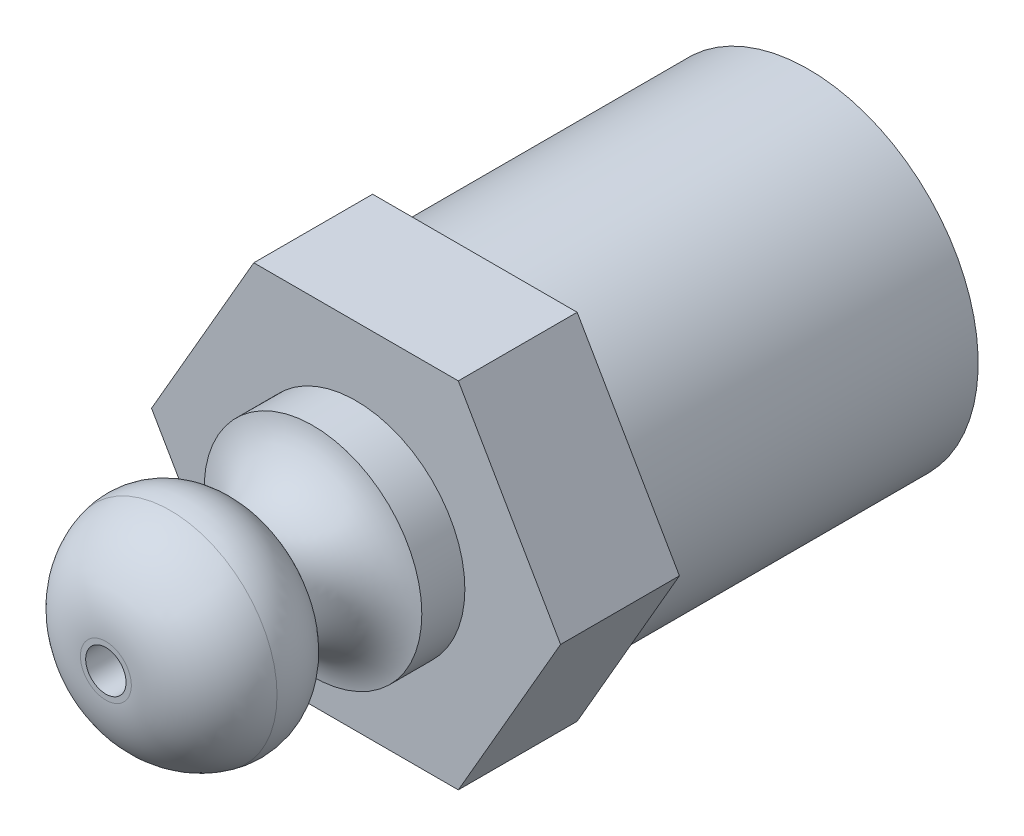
ISO-10303-21;
HEADER;
FILE_DESCRIPTION(('STEP AP214'),'2;1');
FILE_NAME('part.step','',(''),(''),'','','');
FILE_SCHEMA(('AUTOMOTIVE_DESIGN { 1 0 10303 214 1 1 1 1 }'));
ENDSEC;
DATA;
#1=APPLICATION_CONTEXT('core data for automotive mechanical design processes');
#2=APPLICATION_PROTOCOL_DEFINITION('international standard','automotive_design',2000,#1);
#3=PRODUCT_CONTEXT('',#1,'mechanical');
#4=PRODUCT('Part','Part','',(#3));
#5=PRODUCT_RELATED_PRODUCT_CATEGORY('part','',(#4));
#6=PRODUCT_DEFINITION_FORMATION('','',#4);
#7=PRODUCT_DEFINITION_CONTEXT('part definition',#1,'design');
#8=PRODUCT_DEFINITION('design','',#6,#7);
#9=PRODUCT_DEFINITION_SHAPE('','',#8);
#10=(LENGTH_UNIT() NAMED_UNIT(*) SI_UNIT(.MILLI.,.METRE.));
#11=(NAMED_UNIT(*) PLANE_ANGLE_UNIT() SI_UNIT($,.RADIAN.));
#12=(NAMED_UNIT(*) SI_UNIT($,.STERADIAN.) SOLID_ANGLE_UNIT());
#13=UNCERTAINTY_MEASURE_WITH_UNIT(LENGTH_MEASURE(1.E-05),#10,'distance_accuracy_value','');
#14=(GEOMETRIC_REPRESENTATION_CONTEXT(3) GLOBAL_UNCERTAINTY_ASSIGNED_CONTEXT((#13)) GLOBAL_UNIT_ASSIGNED_CONTEXT((#10,
#11,#12)) REPRESENTATION_CONTEXT('',''));
#15=CARTESIAN_POINT('',(0.,0.,0.));
#16=DIRECTION('',(0.,0.,1.));
#17=DIRECTION('',(1.,0.,0.));
#18=AXIS2_PLACEMENT_3D('',#15,#16,#17);
#19=CARTESIAN_POINT('',(0.,0.,-21.3995));
#20=DIRECTION('',(0.,0.,1.));
#21=DIRECTION('',(1.,0.,0.));
#22=AXIS2_PLACEMENT_3D('',#19,#20,#21);
#23=CYLINDRICAL_SURFACE('',#22,0.615298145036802);
#24=CARTESIAN_POINT('',(0.,0.,0.));
#25=DIRECTION('',(0.,0.,1.));
#26=DIRECTION('',(1.,0.,0.));
#27=AXIS2_PLACEMENT_3D('',#24,#25,#26);
#28=CIRCLE('',#27,0.615298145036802);
#29=CARTESIAN_POINT('',(0.615298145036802,0.,0.));
#30=VERTEX_POINT('',#29);
#31=EDGE_CURVE('E110',#30,#30,#28,.T.);
#32=ORIENTED_EDGE('',*,*,#31,.T.);
#33=EDGE_LOOP('',(#32));
#34=FACE_BOUND('',#33,.T.);
#35=CARTESIAN_POINT('',(0.,0.,-13.7795));
#36=DIRECTION('',(0.,0.,-1.));
#37=DIRECTION('',(-1.,0.,0.));
#38=AXIS2_PLACEMENT_3D('',#35,#36,#37);
#39=CIRCLE('',#38,0.615298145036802);
#40=CARTESIAN_POINT('',(-0.615298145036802,0.,-13.7795));
#41=VERTEX_POINT('',#40);
#42=EDGE_CURVE('E108',#41,#41,#39,.F.);
#43=ORIENTED_EDGE('',*,*,#42,.F.);
#44=EDGE_LOOP('',(#43));
#45=FACE_BOUND('',#44,.T.);
#46=ADVANCED_FACE('F16',(#34,#45),#23,.F.);
#47=CARTESIAN_POINT('',(-6.22935008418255,0.,-21.3995));
#48=DIRECTION('',(0.866025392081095,-0.500000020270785,0.));
#49=DIRECTION('',(0.500000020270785,0.866025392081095,0.));
#50=AXIS2_PLACEMENT_3D('',#47,#48,#49);
#51=PLANE('',#50);
#52=DIRECTION('',(-0.500000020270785,-0.866025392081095,0.));
#53=VECTOR('',#52,1.);
#54=CARTESIAN_POINT('',(-6.22935008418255,0.,-7.62));
#55=LINE('',#54,#53);
#56=CARTESIAN_POINT('',(-3.11467495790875,5.39477527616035,-7.62));
#57=VERTEX_POINT('',#56);
#58=CARTESIAN_POINT('',(-6.22935008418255,0.,-7.62));
#59=VERTEX_POINT('',#58);
#60=EDGE_CURVE('E31',#57,#59,#55,.T.);
#61=ORIENTED_EDGE('',*,*,#60,.F.);
#62=DIRECTION('',(0.,0.,1.));
#63=VECTOR('',#62,1.);
#64=CARTESIAN_POINT('',(-3.11467495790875,5.39477527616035,-21.3995));
#65=LINE('',#64,#63);
#66=CARTESIAN_POINT('',(-3.11467495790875,5.39477527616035,-11.2395));
#67=VERTEX_POINT('',#66);
#68=EDGE_CURVE('E102',#67,#57,#65,.T.);
#69=ORIENTED_EDGE('',*,*,#68,.F.);
#70=DIRECTION('',(0.500000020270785,0.866025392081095,0.));
#71=VECTOR('',#70,1.);
#72=CARTESIAN_POINT('',(-6.22935008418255,0.,-11.2395));
#73=LINE('',#72,#71);
#74=CARTESIAN_POINT('',(-6.22935008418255,0.,-11.2395));
#75=VERTEX_POINT('',#74);
#76=EDGE_CURVE('E93',#75,#67,#73,.T.);
#77=ORIENTED_EDGE('',*,*,#76,.F.);
#78=DIRECTION('',(0.,0.,1.));
#79=VECTOR('',#78,1.);
#80=CARTESIAN_POINT('',(-6.22935008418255,0.,-21.3995));
#81=LINE('',#80,#79);
#82=EDGE_CURVE('E89',#75,#59,#81,.T.);
#83=ORIENTED_EDGE('',*,*,#82,.T.);
#84=EDGE_LOOP('',(#61,#69,#77,#83));
#85=FACE_BOUND('',#84,.T.);
#86=ADVANCED_FACE('F18',(#85),#51,.F.);
#87=CARTESIAN_POINT('',(-3.11467495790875,5.39477527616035,-21.3995));
#88=DIRECTION('',(0.,-1.,0.));
#89=DIRECTION('',(1.,0.,0.));
#90=AXIS2_PLACEMENT_3D('',#87,#88,#89);
#91=PLANE('',#90);
#92=DIRECTION('',(-1.,0.,0.));
#93=VECTOR('',#92,1.);
#94=CARTESIAN_POINT('',(-3.11467495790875,5.39477527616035,-7.62));
#95=LINE('',#94,#93);
#96=CARTESIAN_POINT('',(3.11467495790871,5.39477527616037,-7.62));
#97=VERTEX_POINT('',#96);
#98=EDGE_CURVE('E193',#97,#57,#95,.T.);
#99=ORIENTED_EDGE('',*,*,#98,.F.);
#100=DIRECTION('',(0.,0.,1.));
#101=VECTOR('',#100,1.);
#102=CARTESIAN_POINT('',(3.11467495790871,5.39477527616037,-21.3995));
#103=LINE('',#102,#101);
#104=CARTESIAN_POINT('',(3.11467495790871,5.39477527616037,-11.2395));
#105=VERTEX_POINT('',#104);
#106=EDGE_CURVE('E99',#105,#97,#103,.T.);
#107=ORIENTED_EDGE('',*,*,#106,.F.);
#108=DIRECTION('',(1.,0.,0.));
#109=VECTOR('',#108,1.);
#110=CARTESIAN_POINT('',(-3.11467495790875,5.39477527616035,-11.2395));
#111=LINE('',#110,#109);
#112=EDGE_CURVE('E203',#67,#105,#111,.T.);
#113=ORIENTED_EDGE('',*,*,#112,.F.);
#114=ORIENTED_EDGE('',*,*,#68,.T.);
#115=EDGE_LOOP('',(#99,#107,#113,#114));
#116=FACE_BOUND('',#115,.T.);
#117=ADVANCED_FACE('F142',(#116),#91,.F.);
#118=CARTESIAN_POINT('',(3.11467495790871,5.39477527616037,-21.3995));
#119=DIRECTION('',(-0.866025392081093,-0.500000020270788,0.));
#120=DIRECTION('',(0.500000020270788,-0.866025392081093,0.));
#121=AXIS2_PLACEMENT_3D('',#118,#119,#120);
#122=PLANE('',#121);
#123=DIRECTION('',(-0.500000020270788,0.866025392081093,0.));
#124=VECTOR('',#123,1.);
#125=CARTESIAN_POINT('',(3.11467495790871,5.39477527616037,-7.62));
#126=LINE('',#125,#124);
#127=CARTESIAN_POINT('',(6.22935008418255,0.,-7.62));
#128=VERTEX_POINT('',#127);
#129=EDGE_CURVE('E196',#128,#97,#126,.T.);
#130=ORIENTED_EDGE('',*,*,#129,.F.);
#131=DIRECTION('',(0.,0.,1.));
#132=VECTOR('',#131,1.);
#133=CARTESIAN_POINT('',(6.22935008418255,0.,-21.3995));
#134=LINE('',#133,#132);
#135=CARTESIAN_POINT('',(6.22935008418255,0.,-11.2395));
#136=VERTEX_POINT('',#135);
#137=EDGE_CURVE('E91',#136,#128,#134,.T.);
#138=ORIENTED_EDGE('',*,*,#137,.F.);
#139=DIRECTION('',(0.500000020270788,-0.866025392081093,0.));
#140=VECTOR('',#139,1.);
#141=CARTESIAN_POINT('',(3.11467495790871,5.39477527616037,-11.2395));
#142=LINE('',#141,#140);
#143=EDGE_CURVE('E201',#105,#136,#142,.T.);
#144=ORIENTED_EDGE('',*,*,#143,.F.);
#145=ORIENTED_EDGE('',*,*,#106,.T.);
#146=EDGE_LOOP('',(#130,#138,#144,#145));
#147=FACE_BOUND('',#146,.T.);
#148=ADVANCED_FACE('F181',(#147),#122,.F.);
#149=CARTESIAN_POINT('',(6.22935008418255,0.,-21.3995));
#150=DIRECTION('',(-0.866025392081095,0.500000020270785,0.));
#151=DIRECTION('',(-0.500000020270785,-0.866025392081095,0.));
#152=AXIS2_PLACEMENT_3D('',#149,#150,#151);
#153=PLANE('',#152);
#154=DIRECTION('',(0.500000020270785,0.866025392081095,0.));
#155=VECTOR('',#154,1.);
#156=CARTESIAN_POINT('',(6.22935008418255,0.,-7.62));
#157=LINE('',#156,#155);
#158=CARTESIAN_POINT('',(3.11467495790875,-5.39477527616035,-7.62));
#159=VERTEX_POINT('',#158);
#160=EDGE_CURVE('E85',#159,#128,#157,.T.);
#161=ORIENTED_EDGE('',*,*,#160,.F.);
#162=DIRECTION('',(0.,0.,1.));
#163=VECTOR('',#162,1.);
#164=CARTESIAN_POINT('',(3.11467495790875,-5.39477527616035,-21.3995));
#165=LINE('',#164,#163);
#166=CARTESIAN_POINT('',(3.11467495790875,-5.39477527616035,-11.2395));
#167=VERTEX_POINT('',#166);
#168=EDGE_CURVE('E84',#167,#159,#165,.T.);
#169=ORIENTED_EDGE('',*,*,#168,.F.);
#170=DIRECTION('',(-0.500000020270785,-0.866025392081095,0.));
#171=VECTOR('',#170,1.);
#172=CARTESIAN_POINT('',(6.22935008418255,0.,-11.2395));
#173=LINE('',#172,#171);
#174=EDGE_CURVE('E204',#136,#167,#173,.T.);
#175=ORIENTED_EDGE('',*,*,#174,.F.);
#176=ORIENTED_EDGE('',*,*,#137,.T.);
#177=EDGE_LOOP('',(#161,#169,#175,#176));
#178=FACE_BOUND('',#177,.T.);
#179=ADVANCED_FACE('F178',(#178),#153,.F.);
#180=CARTESIAN_POINT('',(3.11467495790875,-5.39477527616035,-21.3995));
#181=DIRECTION('',(0.,1.,0.));
#182=DIRECTION('',(-1.,0.,0.));
#183=AXIS2_PLACEMENT_3D('',#180,#181,#182);
#184=PLANE('',#183);
#185=DIRECTION('',(1.,0.,0.));
#186=VECTOR('',#185,1.);
#187=CARTESIAN_POINT('',(3.11467495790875,-5.39477527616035,-7.62));
#188=LINE('',#187,#186);
#189=CARTESIAN_POINT('',(-3.11467495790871,-5.39477527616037,-7.62));
#190=VERTEX_POINT('',#189);
#191=EDGE_CURVE('E69',#190,#159,#188,.T.);
#192=ORIENTED_EDGE('',*,*,#191,.F.);
#193=DIRECTION('',(0.,0.,1.));
#194=VECTOR('',#193,1.);
#195=CARTESIAN_POINT('',(-3.11467495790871,-5.39477527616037,-21.3995));
#196=LINE('',#195,#194);
#197=CARTESIAN_POINT('',(-3.11467495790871,-5.39477527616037,-11.2395));
#198=VERTEX_POINT('',#197);
#199=EDGE_CURVE('E82',#198,#190,#196,.T.);
#200=ORIENTED_EDGE('',*,*,#199,.F.);
#201=DIRECTION('',(-1.,0.,0.));
#202=VECTOR('',#201,1.);
#203=CARTESIAN_POINT('',(3.11467495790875,-5.39477527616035,-11.2395));
#204=LINE('',#203,#202);
#205=EDGE_CURVE('E39',#167,#198,#204,.T.);
#206=ORIENTED_EDGE('',*,*,#205,.F.);
#207=ORIENTED_EDGE('',*,*,#168,.T.);
#208=EDGE_LOOP('',(#192,#200,#206,#207));
#209=FACE_BOUND('',#208,.T.);
#210=ADVANCED_FACE('F81',(#209),#184,.F.);
#211=CARTESIAN_POINT('',(-3.11467495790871,-5.39477527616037,-21.3995));
#212=DIRECTION('',(0.866025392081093,0.500000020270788,0.));
#213=DIRECTION('',(-0.500000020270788,0.866025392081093,0.));
#214=AXIS2_PLACEMENT_3D('',#211,#212,#213);
#215=PLANE('',#214);
#216=DIRECTION('',(0.500000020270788,-0.866025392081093,0.));
#217=VECTOR('',#216,1.);
#218=CARTESIAN_POINT('',(-3.11467495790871,-5.39477527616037,-7.62));
#219=LINE('',#218,#217);
#220=EDGE_CURVE('E66',#59,#190,#219,.T.);
#221=ORIENTED_EDGE('',*,*,#220,.F.);
#222=ORIENTED_EDGE('',*,*,#82,.F.);
#223=DIRECTION('',(-0.500000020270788,0.866025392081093,0.));
#224=VECTOR('',#223,1.);
#225=CARTESIAN_POINT('',(-3.11467495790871,-5.39477527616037,-11.2395));
#226=LINE('',#225,#224);
#227=EDGE_CURVE('E76',#198,#75,#226,.T.);
#228=ORIENTED_EDGE('',*,*,#227,.F.);
#229=ORIENTED_EDGE('',*,*,#199,.T.);
#230=EDGE_LOOP('',(#221,#222,#228,#229));
#231=FACE_BOUND('',#230,.T.);
#232=ADVANCED_FACE('F88',(#231),#215,.F.);
#233=CARTESIAN_POINT('',(0.,0.,-11.2395));
#234=DIRECTION('',(0.,0.,-1.));
#235=DIRECTION('',(-1.,0.,0.));
#236=AXIS2_PLACEMENT_3D('',#233,#234,#235);
#237=PLANE('',#236);
#238=CARTESIAN_POINT('',(0.,0.,-11.2395));
#239=DIRECTION('',(0.,0.,-1.));
#240=DIRECTION('',(-1.,0.,0.));
#241=AXIS2_PLACEMENT_3D('',#238,#239,#240);
#242=CIRCLE('',#241,5.1689);
#243=CARTESIAN_POINT('',(-5.1689,0.,-11.2395));
#244=VERTEX_POINT('',#243);
#245=EDGE_CURVE('E213',#244,#244,#242,.T.);
#246=ORIENTED_EDGE('',*,*,#245,.F.);
#247=EDGE_LOOP('',(#246));
#248=FACE_BOUND('',#247,.T.);
#249=ORIENTED_EDGE('',*,*,#76,.T.);
#250=ORIENTED_EDGE('',*,*,#112,.T.);
#251=ORIENTED_EDGE('',*,*,#143,.T.);
#252=ORIENTED_EDGE('',*,*,#174,.T.);
#253=ORIENTED_EDGE('',*,*,#205,.T.);
#254=ORIENTED_EDGE('',*,*,#227,.T.);
#255=EDGE_LOOP('',(#249,#250,#251,#252,#253,#254));
#256=FACE_BOUND('',#255,.T.);
#257=ADVANCED_FACE('F164',(#248,#256),#237,.T.);
#258=CARTESIAN_POINT('',(0.,0.,-11.2395));
#259=DIRECTION('',(0.,0.,-1.));
#260=DIRECTION('',(-1.,0.,0.));
#261=AXIS2_PLACEMENT_3D('',#258,#259,#260);
#262=CYLINDRICAL_SURFACE('',#261,5.1689);
#263=ORIENTED_EDGE('',*,*,#245,.T.);
#264=EDGE_LOOP('',(#263));
#265=FACE_BOUND('',#264,.T.);
#266=CARTESIAN_POINT('',(0.,0.,-21.3995));
#267=DIRECTION('',(0.,0.,-1.));
#268=DIRECTION('',(-1.,0.,0.));
#269=AXIS2_PLACEMENT_3D('',#266,#267,#268);
#270=CIRCLE('',#269,5.1689);
#271=CARTESIAN_POINT('',(-5.1689,0.,-21.3995));
#272=VERTEX_POINT('',#271);
#273=EDGE_CURVE('E210',#272,#272,#270,.T.);
#274=ORIENTED_EDGE('',*,*,#273,.F.);
#275=EDGE_LOOP('',(#274));
#276=FACE_BOUND('',#275,.T.);
#277=ADVANCED_FACE('F161',(#265,#276),#262,.T.);
#278=CARTESIAN_POINT('',(0.,10.7895502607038,-21.3995));
#279=DIRECTION('',(0.,0.,-1.));
#280=DIRECTION('',(-1.,0.,0.));
#281=AXIS2_PLACEMENT_3D('',#278,#279,#280);
#282=PLANE('',#281);
#283=CARTESIAN_POINT('',(0.,0.,-21.3995));
#284=DIRECTION('',(0.,0.,-1.));
#285=DIRECTION('',(-1.,0.,0.));
#286=AXIS2_PLACEMENT_3D('',#283,#284,#285);
#287=CIRCLE('',#286,3.63663389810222);
#288=CARTESIAN_POINT('',(-3.63663389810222,0.,-21.3995));
#289=VERTEX_POINT('',#288);
#290=EDGE_CURVE('E229',#289,#289,#287,.T.);
#291=ORIENTED_EDGE('',*,*,#290,.F.);
#292=EDGE_LOOP('',(#291));
#293=FACE_BOUND('',#292,.T.);
#294=ORIENTED_EDGE('',*,*,#273,.T.);
#295=EDGE_LOOP('',(#294));
#296=FACE_BOUND('',#295,.T.);
#297=ADVANCED_FACE('F159',(#293,#296),#282,.T.);
#298=CARTESIAN_POINT('',(0.,0.,-7.62));
#299=DIRECTION('',(0.,0.,1.));
#300=DIRECTION('',(1.,0.,0.));
#301=AXIS2_PLACEMENT_3D('',#298,#299,#300);
#302=PLANE('',#301);
#303=CARTESIAN_POINT('',(0.,0.,-7.62));
#304=DIRECTION('',(0.,0.,1.));
#305=DIRECTION('',(1.,0.,0.));
#306=AXIS2_PLACEMENT_3D('',#303,#304,#305);
#307=CIRCLE('',#306,3.3147);
#308=CARTESIAN_POINT('',(3.3147,0.,-7.62));
#309=VERTEX_POINT('',#308);
#310=EDGE_CURVE('E86',#309,#309,#307,.T.);
#311=ORIENTED_EDGE('',*,*,#310,.F.);
#312=EDGE_LOOP('',(#311));
#313=FACE_BOUND('',#312,.T.);
#314=ORIENTED_EDGE('',*,*,#60,.T.);
#315=ORIENTED_EDGE('',*,*,#220,.T.);
#316=ORIENTED_EDGE('',*,*,#191,.T.);
#317=ORIENTED_EDGE('',*,*,#160,.T.);
#318=ORIENTED_EDGE('',*,*,#129,.T.);
#319=ORIENTED_EDGE('',*,*,#98,.T.);
#320=EDGE_LOOP('',(#314,#315,#316,#317,#318,#319));
#321=FACE_BOUND('',#320,.T.);
#322=ADVANCED_FACE('F68',(#313,#321),#302,.T.);
#323=CARTESIAN_POINT('',(0.,0.,-7.62));
#324=DIRECTION('',(0.,0.,1.));
#325=DIRECTION('',(1.,0.,0.));
#326=AXIS2_PLACEMENT_3D('',#323,#324,#325);
#327=CYLINDRICAL_SURFACE('',#326,3.3147);
#328=CARTESIAN_POINT('',(0.,0.,-6.30858094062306));
#329=DIRECTION('',(0.,0.,1.));
#330=DIRECTION('',(1.,0.,0.));
#331=AXIS2_PLACEMENT_3D('',#328,#329,#330);
#332=CIRCLE('',#331,3.3147);
#333=CARTESIAN_POINT('',(3.3147,0.,-6.30858094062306));
#334=VERTEX_POINT('',#333);
#335=EDGE_CURVE('E234',#334,#334,#332,.T.);
#336=CARTESIAN_POINT('',(3.3147,0.,-6.30858094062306));
#337=CARTESIAN_POINT('',(3.3147,0.,-6.32224155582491));
#338=CARTESIAN_POINT('',(3.3147,0.,-6.33590217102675));
#339=CARTESIAN_POINT('',(3.3147,0.,-6.36322340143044));
#340=CARTESIAN_POINT('',(3.3147,0.,-6.37688401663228));
#341=CARTESIAN_POINT('',(3.3147,0.,-6.40420524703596));
#342=CARTESIAN_POINT('',(3.3147,0.,-6.41786586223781));
#343=CARTESIAN_POINT('',(3.3147,0.,-6.44518709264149));
#344=CARTESIAN_POINT('',(3.3147,0.,-6.45884770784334));
#345=CARTESIAN_POINT('',(3.3147,0.,-6.48616893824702));
#346=CARTESIAN_POINT('',(3.3147,0.,-6.49982955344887));
#347=CARTESIAN_POINT('',(3.3147,0.,-6.52715078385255));
#348=CARTESIAN_POINT('',(3.3147,0.,-6.5408113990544));
#349=CARTESIAN_POINT('',(3.3147,0.,-6.56813262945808));
#350=CARTESIAN_POINT('',(3.3147,0.,-6.58179324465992));
#351=CARTESIAN_POINT('',(3.3147,0.,-6.60911447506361));
#352=CARTESIAN_POINT('',(3.3147,0.,-6.62277509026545));
#353=CARTESIAN_POINT('',(3.3147,0.,-6.65009632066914));
#354=CARTESIAN_POINT('',(3.3147,0.,-6.66375693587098));
#355=CARTESIAN_POINT('',(3.3147,0.,-6.69107816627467));
#356=CARTESIAN_POINT('',(3.3147,0.,-6.70473878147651));
#357=CARTESIAN_POINT('',(3.3147,0.,-6.7320600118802));
#358=CARTESIAN_POINT('',(3.3147,0.,-6.74572062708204));
#359=CARTESIAN_POINT('',(3.3147,0.,-6.77304185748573));
#360=CARTESIAN_POINT('',(3.3147,0.,-6.78670247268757));
#361=CARTESIAN_POINT('',(3.3147,0.,-6.81402370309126));
#362=CARTESIAN_POINT('',(3.3147,0.,-6.8276843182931));
#363=CARTESIAN_POINT('',(3.3147,0.,-6.85500554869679));
#364=CARTESIAN_POINT('',(3.3147,0.,-6.86866616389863));
#365=CARTESIAN_POINT('',(3.3147,0.,-6.89598739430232));
#366=CARTESIAN_POINT('',(3.3147,0.,-6.90964800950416));
#367=CARTESIAN_POINT('',(3.3147,0.,-6.93696923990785));
#368=CARTESIAN_POINT('',(3.3147,0.,-6.95062985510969));
#369=CARTESIAN_POINT('',(3.3147,0.,-6.97795108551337));
#370=CARTESIAN_POINT('',(3.3147,0.,-6.99161170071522));
#371=CARTESIAN_POINT('',(3.3147,0.,-7.0189329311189));
#372=CARTESIAN_POINT('',(3.3147,0.,-7.03259354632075));
#373=CARTESIAN_POINT('',(3.3147,0.,-7.05991477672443));
#374=CARTESIAN_POINT('',(3.3147,0.,-7.07357539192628));
#375=CARTESIAN_POINT('',(3.3147,0.,-7.10089662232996));
#376=CARTESIAN_POINT('',(3.3147,0.,-7.11455723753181));
#377=CARTESIAN_POINT('',(3.3147,0.,-7.14187846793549));
#378=CARTESIAN_POINT('',(3.3147,0.,-7.15553908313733));
#379=CARTESIAN_POINT('',(3.3147,0.,-7.18286031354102));
#380=CARTESIAN_POINT('',(3.3147,0.,-7.19652092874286));
#381=CARTESIAN_POINT('',(3.3147,0.,-7.22384215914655));
#382=CARTESIAN_POINT('',(3.3147,0.,-7.23750277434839));
#383=CARTESIAN_POINT('',(3.3147,0.,-7.26482400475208));
#384=CARTESIAN_POINT('',(3.3147,0.,-7.27848461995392));
#385=CARTESIAN_POINT('',(3.3147,0.,-7.30580585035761));
#386=CARTESIAN_POINT('',(3.3147,0.,-7.31946646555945));
#387=CARTESIAN_POINT('',(3.3147,0.,-7.34678769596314));
#388=CARTESIAN_POINT('',(3.3147,0.,-7.36044831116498));
#389=CARTESIAN_POINT('',(3.3147,0.,-7.38776954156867));
#390=CARTESIAN_POINT('',(3.3147,0.,-7.40143015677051));
#391=CARTESIAN_POINT('',(3.3147,0.,-7.4287513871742));
#392=CARTESIAN_POINT('',(3.3147,0.,-7.44241200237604));
#393=CARTESIAN_POINT('',(3.3147,0.,-7.46973323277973));
#394=CARTESIAN_POINT('',(3.3147,0.,-7.48339384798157));
#395=CARTESIAN_POINT('',(3.3147,0.,-7.51071507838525));
#396=CARTESIAN_POINT('',(3.3147,0.,-7.5243756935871));
#397=CARTESIAN_POINT('',(3.3147,0.,-7.55169692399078));
#398=CARTESIAN_POINT('',(3.3147,0.,-7.56535753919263));
#399=CARTESIAN_POINT('',(3.3147,0.,-7.59267876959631));
#400=CARTESIAN_POINT('',(3.3147,0.,-7.60633938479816));
#401=CARTESIAN_POINT('',(3.3147,0.,-7.62));
#402=B_SPLINE_CURVE_WITH_KNOTS('',3,(#336,#337,#338,#339,#340,#341,#342,#343,#344,#345,#346,
#347,#348,#349,#350,#351,#352,#353,#354,#355,#356,#357,#358,#359,#360,#361,#362,#363,#364,#365,
#366,#367,#368,#369,#370,#371,#372,#373,#374,#375,#376,#377,#378,#379,#380,#381,#382,#383,#384,
#385,#386,#387,#388,#389,#390,#391,#392,#393,#394,#395,#396,#397,#398,#399,#400,#401),
.UNSPECIFIED.,.F.,.F.,(4,2,2,2,2,2,2,2,2,2,2,2,2,2,2,2,2,2,2,2,2,2,2,2,2,2,2,2,2,2,2,2,4),(0.,
0.0409818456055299,0.0819636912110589,0.122945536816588,0.163927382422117,0.204909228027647,
0.245891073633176,0.286872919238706,0.327854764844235,0.368836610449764,0.409818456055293,
0.450800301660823,0.491782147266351,0.532763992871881,0.57374583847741,0.614727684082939,
0.655709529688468,0.696691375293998,0.737673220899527,0.778655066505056,0.819636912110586,
0.860618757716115,0.901600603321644,0.942582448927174,0.983564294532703,1.02454614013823,
1.06552798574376,1.10650983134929,1.14749167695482,1.18847352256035,1.22945536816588,
1.27043721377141,1.31141905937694),.UNSPECIFIED.);
#403=EDGE_CURVE('BSEAM153',#334,#309,#402,.T.);
#404=ORIENTED_EDGE('',*,*,#335,.F.);
#405=ORIENTED_EDGE('',*,*,#310,.T.);
#406=ORIENTED_EDGE('',*,*,#403,.T.);
#407=ORIENTED_EDGE('',*,*,#403,.F.);
#408=EDGE_LOOP('',(#404,#406,#405,#407));
#409=FACE_BOUND('',#408,.T.);
#410=ADVANCED_FACE('F153',(#409),#327,.T.);
#411=CARTESIAN_POINT('',(0.,10.7895502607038,0.));
#412=DIRECTION('',(0.,0.,-1.));
#413=DIRECTION('',(-1.,0.,0.));
#414=AXIS2_PLACEMENT_3D('',#411,#412,#413);
#415=PLANE('',#414);
#416=ORIENTED_EDGE('',*,*,#31,.F.);
#417=EDGE_LOOP('',(#416));
#418=FACE_BOUND('',#417,.T.);
#419=CARTESIAN_POINT('',(0.,0.,0.));
#420=DIRECTION('',(0.,0.,-1.));
#421=DIRECTION('',(-1.,0.,0.));
#422=AXIS2_PLACEMENT_3D('',#419,#420,#421);
#423=CIRCLE('',#422,0.7747);
#424=CARTESIAN_POINT('',(-0.7747,0.,0.));
#425=VERTEX_POINT('',#424);
#426=EDGE_CURVE('E75',#425,#425,#423,.F.);
#427=ORIENTED_EDGE('',*,*,#426,.T.);
#428=EDGE_LOOP('',(#427));
#429=FACE_BOUND('',#428,.T.);
#430=ADVANCED_FACE('F152',(#418,#429),#415,.F.);
#431=CARTESIAN_POINT('',(0.,0.,-2.54));
#432=DIRECTION('',(0.,0.,-1.));
#433=DIRECTION('',(-1.,0.,0.));
#434=AXIS2_PLACEMENT_3D('',#431,#432,#433);
#435=DEGENERATE_TOROIDAL_SURFACE('',#434,0.7747,2.54,.T.);
#436=CARTESIAN_POINT('',(0.,0.,-1.96482165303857));
#437=DIRECTION('',(0.,0.,-1.));
#438=DIRECTION('',(-1.,0.,0.));
#439=AXIS2_PLACEMENT_3D('',#436,#437,#438);
#440=CIRCLE('',#439,3.24871897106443);
#441=CARTESIAN_POINT('',(-3.24871897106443,0.,-1.96482165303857));
#442=VERTEX_POINT('',#441);
#443=EDGE_CURVE('E24',#442,#442,#440,.F.);
#444=ORIENTED_EDGE('',*,*,#443,.T.);
#445=EDGE_LOOP('',(#444));
#446=FACE_BOUND('',#445,.T.);
#447=ORIENTED_EDGE('',*,*,#426,.F.);
#448=EDGE_LOOP('',(#447));
#449=FACE_BOUND('',#448,.T.);
#450=ADVANCED_FACE('F115',(#446,#449),#435,.T.);
#451=CARTESIAN_POINT('',(0.,0.,-13.7795));
#452=DIRECTION('',(0.,0.,-1.));
#453=DIRECTION('',(-1.,0.,0.));
#454=AXIS2_PLACEMENT_3D('',#451,#452,#453);
#455=PLANE('',#454);
#456=CARTESIAN_POINT('',(0.,0.,-13.7795));
#457=DIRECTION('',(0.,0.,-1.));
#458=DIRECTION('',(-1.,0.,0.));
#459=AXIS2_PLACEMENT_3D('',#456,#457,#458);
#460=CIRCLE('',#459,3.63663389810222);
#461=CARTESIAN_POINT('',(-3.63663389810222,0.,-13.7795));
#462=VERTEX_POINT('',#461);
#463=EDGE_CURVE('E111',#462,#462,#460,.T.);
#464=ORIENTED_EDGE('',*,*,#463,.T.);
#465=EDGE_LOOP('',(#464));
#466=FACE_BOUND('',#465,.T.);
#467=ORIENTED_EDGE('',*,*,#42,.T.);
#468=EDGE_LOOP('',(#467));
#469=FACE_BOUND('',#468,.T.);
#470=ADVANCED_FACE('F151',(#466,#469),#455,.T.);
#471=CARTESIAN_POINT('',(0.,0.,-13.7795));
#472=DIRECTION('',(0.,0.,-1.));
#473=DIRECTION('',(-1.,0.,0.));
#474=AXIS2_PLACEMENT_3D('',#471,#472,#473);
#475=CYLINDRICAL_SURFACE('',#474,3.63663389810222);
#476=CARTESIAN_POINT('',(-3.63663389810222,0.,-13.7795));
#477=CARTESIAN_POINT('',(-3.63663389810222,0.,-13.858875));
#478=CARTESIAN_POINT('',(-3.63663389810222,0.,-13.93825));
#479=CARTESIAN_POINT('',(-3.63663389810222,0.,-14.097));
#480=CARTESIAN_POINT('',(-3.63663389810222,0.,-14.176375));
#481=CARTESIAN_POINT('',(-3.63663389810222,0.,-14.335125));
#482=CARTESIAN_POINT('',(-3.63663389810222,0.,-14.4145));
#483=CARTESIAN_POINT('',(-3.63663389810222,0.,-14.57325));
#484=CARTESIAN_POINT('',(-3.63663389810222,0.,-14.652625));
#485=CARTESIAN_POINT('',(-3.63663389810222,0.,-14.811375));
#486=CARTESIAN_POINT('',(-3.63663389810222,0.,-14.89075));
#487=CARTESIAN_POINT('',(-3.63663389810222,0.,-15.0495));
#488=CARTESIAN_POINT('',(-3.63663389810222,0.,-15.128875));
#489=CARTESIAN_POINT('',(-3.63663389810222,0.,-15.287625));
#490=CARTESIAN_POINT('',(-3.63663389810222,0.,-15.367));
#491=CARTESIAN_POINT('',(-3.63663389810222,0.,-15.52575));
#492=CARTESIAN_POINT('',(-3.63663389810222,0.,-15.605125));
#493=CARTESIAN_POINT('',(-3.63663389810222,0.,-15.763875));
#494=CARTESIAN_POINT('',(-3.63663389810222,0.,-15.84325));
#495=CARTESIAN_POINT('',(-3.63663389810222,0.,-16.002));
#496=CARTESIAN_POINT('',(-3.63663389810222,0.,-16.081375));
#497=CARTESIAN_POINT('',(-3.63663389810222,0.,-16.240125));
#498=CARTESIAN_POINT('',(-3.63663389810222,0.,-16.3195));
#499=CARTESIAN_POINT('',(-3.63663389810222,0.,-16.47825));
#500=CARTESIAN_POINT('',(-3.63663389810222,0.,-16.557625));
#501=CARTESIAN_POINT('',(-3.63663389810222,0.,-16.716375));
#502=CARTESIAN_POINT('',(-3.63663389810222,0.,-16.79575));
#503=CARTESIAN_POINT('',(-3.63663389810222,0.,-16.9545));
#504=CARTESIAN_POINT('',(-3.63663389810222,0.,-17.033875));
#505=CARTESIAN_POINT('',(-3.63663389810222,0.,-17.192625));
#506=CARTESIAN_POINT('',(-3.63663389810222,0.,-17.272));
#507=CARTESIAN_POINT('',(-3.63663389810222,0.,-17.43075));
#508=CARTESIAN_POINT('',(-3.63663389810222,0.,-17.510125));
#509=CARTESIAN_POINT('',(-3.63663389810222,0.,-17.668875));
#510=CARTESIAN_POINT('',(-3.63663389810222,0.,-17.74825));
#511=CARTESIAN_POINT('',(-3.63663389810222,0.,-17.907));
#512=CARTESIAN_POINT('',(-3.63663389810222,0.,-17.986375));
#513=CARTESIAN_POINT('',(-3.63663389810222,0.,-18.145125));
#514=CARTESIAN_POINT('',(-3.63663389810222,0.,-18.2245));
#515=CARTESIAN_POINT('',(-3.63663389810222,0.,-18.38325));
#516=CARTESIAN_POINT('',(-3.63663389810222,0.,-18.462625));
#517=CARTESIAN_POINT('',(-3.63663389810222,0.,-18.621375));
#518=CARTESIAN_POINT('',(-3.63663389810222,0.,-18.70075));
#519=CARTESIAN_POINT('',(-3.63663389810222,0.,-18.8595));
#520=CARTESIAN_POINT('',(-3.63663389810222,0.,-18.938875));
#521=CARTESIAN_POINT('',(-3.63663389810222,0.,-19.097625));
#522=CARTESIAN_POINT('',(-3.63663389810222,0.,-19.177));
#523=CARTESIAN_POINT('',(-3.63663389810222,0.,-19.33575));
#524=CARTESIAN_POINT('',(-3.63663389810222,0.,-19.415125));
#525=CARTESIAN_POINT('',(-3.63663389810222,0.,-19.573875));
#526=CARTESIAN_POINT('',(-3.63663389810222,0.,-19.65325));
#527=CARTESIAN_POINT('',(-3.63663389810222,0.,-19.812));
#528=CARTESIAN_POINT('',(-3.63663389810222,0.,-19.891375));
#529=CARTESIAN_POINT('',(-3.63663389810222,0.,-20.050125));
#530=CARTESIAN_POINT('',(-3.63663389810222,0.,-20.1295));
#531=CARTESIAN_POINT('',(-3.63663389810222,0.,-20.28825));
#532=CARTESIAN_POINT('',(-3.63663389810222,0.,-20.367625));
#533=CARTESIAN_POINT('',(-3.63663389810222,0.,-20.526375));
#534=CARTESIAN_POINT('',(-3.63663389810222,0.,-20.60575));
#535=CARTESIAN_POINT('',(-3.63663389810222,0.,-20.7645));
#536=CARTESIAN_POINT('',(-3.63663389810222,0.,-20.843875));
#537=CARTESIAN_POINT('',(-3.63663389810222,0.,-21.002625));
#538=CARTESIAN_POINT('',(-3.63663389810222,0.,-21.082));
#539=CARTESIAN_POINT('',(-3.63663389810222,0.,-21.24075));
#540=CARTESIAN_POINT('',(-3.63663389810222,0.,-21.320125));
#541=CARTESIAN_POINT('',(-3.63663389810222,0.,-21.3995));
#542=B_SPLINE_CURVE_WITH_KNOTS('',3,(#476,#477,#478,#479,#480,#481,#482,#483,#484,#485,#486,
#487,#488,#489,#490,#491,#492,#493,#494,#495,#496,#497,#498,#499,#500,#501,#502,#503,#504,#505,
#506,#507,#508,#509,#510,#511,#512,#513,#514,#515,#516,#517,#518,#519,#520,#521,#522,#523,#524,
#525,#526,#527,#528,#529,#530,#531,#532,#533,#534,#535,#536,#537,#538,#539,#540,#541),
.UNSPECIFIED.,.F.,.F.,(4,2,2,2,2,2,2,2,2,2,2,2,2,2,2,2,2,2,2,2,2,2,2,2,2,2,2,2,2,2,2,2,4),(0.,
0.238124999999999,0.476249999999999,0.714375,0.952499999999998,1.190625,1.42875,1.666875,1.905,
2.143125,2.38125,2.619375,2.8575,3.095625,3.33375,3.571875,3.81,4.048125,4.28625,4.524375,
4.7625,5.000625,5.23875,5.476875,5.715,5.953125,6.19125,6.429375,6.6675,6.905625,7.14375,
7.381875,7.62),.UNSPECIFIED.);
#543=EDGE_CURVE('BSEAM131',#462,#289,#542,.T.);
#544=ORIENTED_EDGE('',*,*,#463,.F.);
#545=ORIENTED_EDGE('',*,*,#290,.T.);
#546=ORIENTED_EDGE('',*,*,#543,.T.);
#547=ORIENTED_EDGE('',*,*,#543,.F.);
#548=EDGE_LOOP('',(#544,#546,#545,#547));
#549=FACE_BOUND('',#548,.T.);
#550=ADVANCED_FACE('F131',(#549),#475,.F.);
#551=CARTESIAN_POINT('',(0.,0.,0.));
#552=DIRECTION('',(0.,0.,1.));
#553=DIRECTION('',(1.,0.,0.));
#554=AXIS2_PLACEMENT_3D('',#551,#552,#553);
#555=CYLINDRICAL_SURFACE('',#554,1.69885210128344);
#556=CARTESIAN_POINT('',(0.,0.,-4.42565341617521));
#557=DIRECTION('',(0.,0.,-1.));
#558=DIRECTION('',(-1.,0.,0.));
#559=AXIS2_PLACEMENT_3D('',#556,#557,#558);
#560=CIRCLE('',#559,1.69885210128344);
#561=CARTESIAN_POINT('',(-1.69885210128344,0.,-4.42565341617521));
#562=VERTEX_POINT('',#561);
#563=EDGE_CURVE('E10',#562,#562,#560,.F.);
#564=ORIENTED_EDGE('',*,*,#563,.T.);
#565=EDGE_LOOP('',(#564));
#566=FACE_BOUND('',#565,.T.);
#567=CARTESIAN_POINT('',(0.,0.,-4.2765257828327));
#568=DIRECTION('',(0.,0.,1.));
#569=DIRECTION('',(1.,0.,0.));
#570=AXIS2_PLACEMENT_3D('',#567,#568,#569);
#571=CIRCLE('',#570,1.69885210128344);
#572=CARTESIAN_POINT('',(1.69885210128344,0.,-4.2765257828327));
#573=VERTEX_POINT('',#572);
#574=EDGE_CURVE('E232',#573,#573,#571,.T.);
#575=ORIENTED_EDGE('',*,*,#574,.F.);
#576=EDGE_LOOP('',(#575));
#577=FACE_BOUND('',#576,.T.);
#578=ADVANCED_FACE('F121',(#566,#577),#555,.T.);
#579=CARTESIAN_POINT('',(0.,0.,-2.39620541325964));
#580=DIRECTION('',(0.,0.,-1.));
#581=DIRECTION('',(-1.,0.,0.));
#582=AXIS2_PLACEMENT_3D('',#579,#580,#581);
#583=DEGENERATE_TOROIDAL_SURFACE('',#582,1.39320474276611,1.905,.T.);
#584=ORIENTED_EDGE('',*,*,#574,.T.);
#585=EDGE_LOOP('',(#584));
#586=FACE_BOUND('',#585,.T.);
#587=ORIENTED_EDGE('',*,*,#443,.F.);
#588=EDGE_LOOP('',(#587));
#589=FACE_BOUND('',#588,.T.);
#590=ADVANCED_FACE('F118',(#586,#589),#583,.T.);
#591=CARTESIAN_POINT('',(0.,0.,-4.42565341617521));
#592=DIRECTION('',(0.,0.,-1.));
#593=DIRECTION('',(-1.,0.,0.));
#594=AXIS2_PLACEMENT_3D('',#591,#592,#593);
#595=TOROIDAL_SURFACE('',#594,3.60385210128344,1.905);
#596=ORIENTED_EDGE('',*,*,#335,.T.);
#597=EDGE_LOOP('',(#596));
#598=FACE_BOUND('',#597,.T.);
#599=ORIENTED_EDGE('',*,*,#563,.F.);
#600=EDGE_LOOP('',(#599));
#601=FACE_BOUND('',#600,.T.);
#602=ADVANCED_FACE('F120',(#598,#601),#595,.F.);
#603=CLOSED_SHELL('',(#46,#86,#117,#148,#179,#210,#232,#257,#277,#297,#322,#410,#430,#450,#470,
#550,#578,#590,#602));
#604=MANIFOLD_SOLID_BREP('B1',#603);
#605=ADVANCED_BREP_SHAPE_REPRESENTATION('',(#18,#604),#14);
#606=SHAPE_DEFINITION_REPRESENTATION(#9,#605);
ENDSEC;
END-ISO-10303-21;
